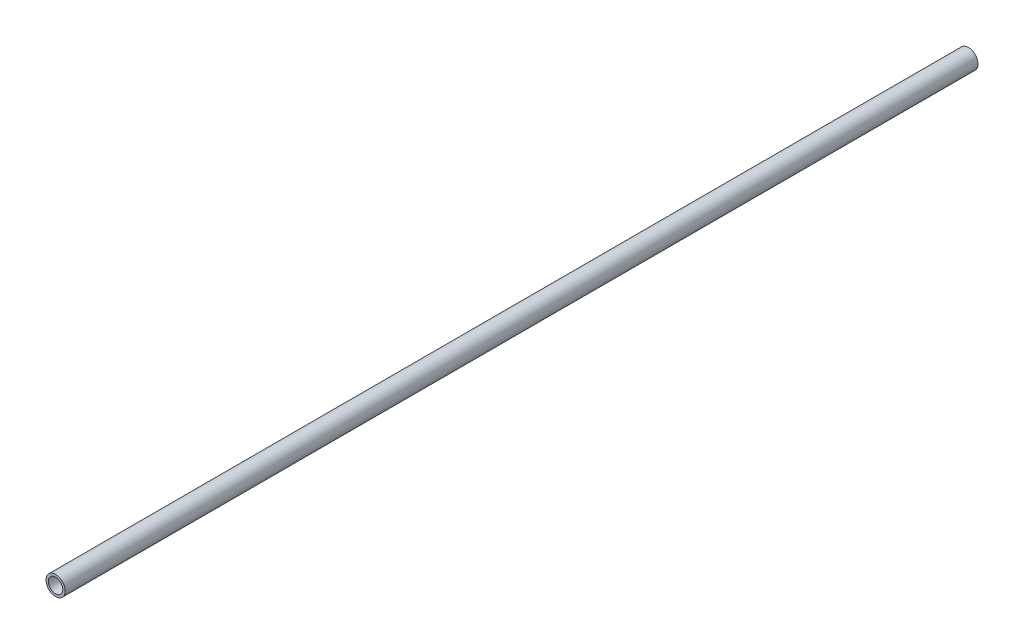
ISO-10303-21;
HEADER;
FILE_DESCRIPTION(('STEP AP214'),'2;1');
FILE_NAME('part.step','',(''),(''),'','','');
FILE_SCHEMA(('AUTOMOTIVE_DESIGN { 1 0 10303 214 1 1 1 1 }'));
ENDSEC;
DATA;
#1=APPLICATION_CONTEXT('core data for automotive mechanical design processes');
#2=APPLICATION_PROTOCOL_DEFINITION('international standard','automotive_design',2000,#1);
#3=PRODUCT_CONTEXT('',#1,'mechanical');
#4=PRODUCT('Part','Part','',(#3));
#5=PRODUCT_RELATED_PRODUCT_CATEGORY('part','',(#4));
#6=PRODUCT_DEFINITION_FORMATION('','',#4);
#7=PRODUCT_DEFINITION_CONTEXT('part definition',#1,'design');
#8=PRODUCT_DEFINITION('design','',#6,#7);
#9=PRODUCT_DEFINITION_SHAPE('','',#8);
#10=(LENGTH_UNIT() NAMED_UNIT(*) SI_UNIT(.MILLI.,.METRE.));
#11=(NAMED_UNIT(*) PLANE_ANGLE_UNIT() SI_UNIT($,.RADIAN.));
#12=(NAMED_UNIT(*) SI_UNIT($,.STERADIAN.) SOLID_ANGLE_UNIT());
#13=UNCERTAINTY_MEASURE_WITH_UNIT(LENGTH_MEASURE(1.E-05),#10,'distance_accuracy_value','');
#14=(GEOMETRIC_REPRESENTATION_CONTEXT(3) GLOBAL_UNCERTAINTY_ASSIGNED_CONTEXT((#13)) GLOBAL_UNIT_ASSIGNED_CONTEXT((#10,
#11,#12)) REPRESENTATION_CONTEXT('',''));
#15=CARTESIAN_POINT('',(0.,0.,0.));
#16=DIRECTION('',(0.,0.,1.));
#17=DIRECTION('',(1.,0.,0.));
#18=AXIS2_PLACEMENT_3D('',#15,#16,#17);
#19=CARTESIAN_POINT('',(0.,0.,380.));
#20=DIRECTION('',(0.,0.,1.));
#21=DIRECTION('',(1.,0.,0.));
#22=AXIS2_PLACEMENT_3D('',#19,#20,#21);
#23=PLANE('',#22);
#24=CARTESIAN_POINT('',(0.,0.,380.));
#25=DIRECTION('',(0.,0.,1.));
#26=DIRECTION('',(1.,0.,0.));
#27=AXIS2_PLACEMENT_3D('',#24,#25,#26);
#28=CIRCLE('',#27,4.);
#29=CARTESIAN_POINT('',(4.,0.,380.));
#30=VERTEX_POINT('',#29);
#31=EDGE_CURVE('E11',#30,#30,#28,.T.);
#32=ORIENTED_EDGE('',*,*,#31,.T.);
#33=EDGE_LOOP('',(#32));
#34=FACE_BOUND('',#33,.T.);
#35=CARTESIAN_POINT('',(0.,0.,380.));
#36=DIRECTION('',(0.,0.,1.));
#37=DIRECTION('',(1.,0.,0.));
#38=AXIS2_PLACEMENT_3D('',#35,#36,#37);
#39=CIRCLE('',#38,3.);
#40=CARTESIAN_POINT('',(3.,0.,380.));
#41=VERTEX_POINT('',#40);
#42=EDGE_CURVE('E58',#41,#41,#39,.T.);
#43=ORIENTED_EDGE('',*,*,#42,.F.);
#44=EDGE_LOOP('',(#43));
#45=FACE_BOUND('',#44,.T.);
#46=ADVANCED_FACE('F47',(#34,#45),#23,.T.);
#47=CARTESIAN_POINT('',(0.,0.,0.));
#48=DIRECTION('',(0.,0.,1.));
#49=DIRECTION('',(1.,0.,0.));
#50=AXIS2_PLACEMENT_3D('',#47,#48,#49);
#51=PLANE('',#50);
#52=CARTESIAN_POINT('',(0.,0.,0.));
#53=DIRECTION('',(0.,0.,1.));
#54=DIRECTION('',(1.,0.,0.));
#55=AXIS2_PLACEMENT_3D('',#52,#53,#54);
#56=CIRCLE('',#55,4.);
#57=CARTESIAN_POINT('',(4.,0.,0.));
#58=VERTEX_POINT('',#57);
#59=EDGE_CURVE('E51',#58,#58,#56,.T.);
#60=ORIENTED_EDGE('',*,*,#59,.F.);
#61=EDGE_LOOP('',(#60));
#62=FACE_BOUND('',#61,.T.);
#63=CARTESIAN_POINT('',(0.,0.,0.));
#64=DIRECTION('',(0.,0.,1.));
#65=DIRECTION('',(1.,0.,0.));
#66=AXIS2_PLACEMENT_3D('',#63,#64,#65);
#67=CIRCLE('',#66,3.);
#68=CARTESIAN_POINT('',(3.,0.,0.));
#69=VERTEX_POINT('',#68);
#70=EDGE_CURVE('E60',#69,#69,#67,.T.);
#71=ORIENTED_EDGE('',*,*,#70,.T.);
#72=EDGE_LOOP('',(#71));
#73=FACE_BOUND('',#72,.T.);
#74=ADVANCED_FACE('F70',(#62,#73),#51,.F.);
#75=CARTESIAN_POINT('',(0.,0.,380.));
#76=DIRECTION('',(0.,0.,-1.));
#77=DIRECTION('',(-1.,0.,0.));
#78=AXIS2_PLACEMENT_3D('',#75,#76,#77);
#79=CYLINDRICAL_SURFACE('',#78,4.);
#80=ORIENTED_EDGE('',*,*,#31,.F.);
#81=EDGE_LOOP('',(#80));
#82=FACE_BOUND('',#81,.T.);
#83=ORIENTED_EDGE('',*,*,#59,.T.);
#84=EDGE_LOOP('',(#83));
#85=FACE_BOUND('',#84,.T.);
#86=ADVANCED_FACE('F49',(#82,#85),#79,.T.);
#87=CARTESIAN_POINT('',(0.,0.,380.));
#88=DIRECTION('',(0.,0.,-1.));
#89=DIRECTION('',(-1.,0.,0.));
#90=AXIS2_PLACEMENT_3D('',#87,#88,#89);
#91=CYLINDRICAL_SURFACE('',#90,3.);
#92=ORIENTED_EDGE('',*,*,#42,.T.);
#93=EDGE_LOOP('',(#92));
#94=FACE_BOUND('',#93,.T.);
#95=ORIENTED_EDGE('',*,*,#70,.F.);
#96=EDGE_LOOP('',(#95));
#97=FACE_BOUND('',#96,.T.);
#98=ADVANCED_FACE('F66',(#94,#97),#91,.F.);
#99=CLOSED_SHELL('',(#46,#74,#86,#98));
#100=MANIFOLD_SOLID_BREP('B2',#99);
#101=ADVANCED_BREP_SHAPE_REPRESENTATION('',(#18,#100),#14);
#102=SHAPE_DEFINITION_REPRESENTATION(#9,#101);
ENDSEC;
END-ISO-10303-21;
